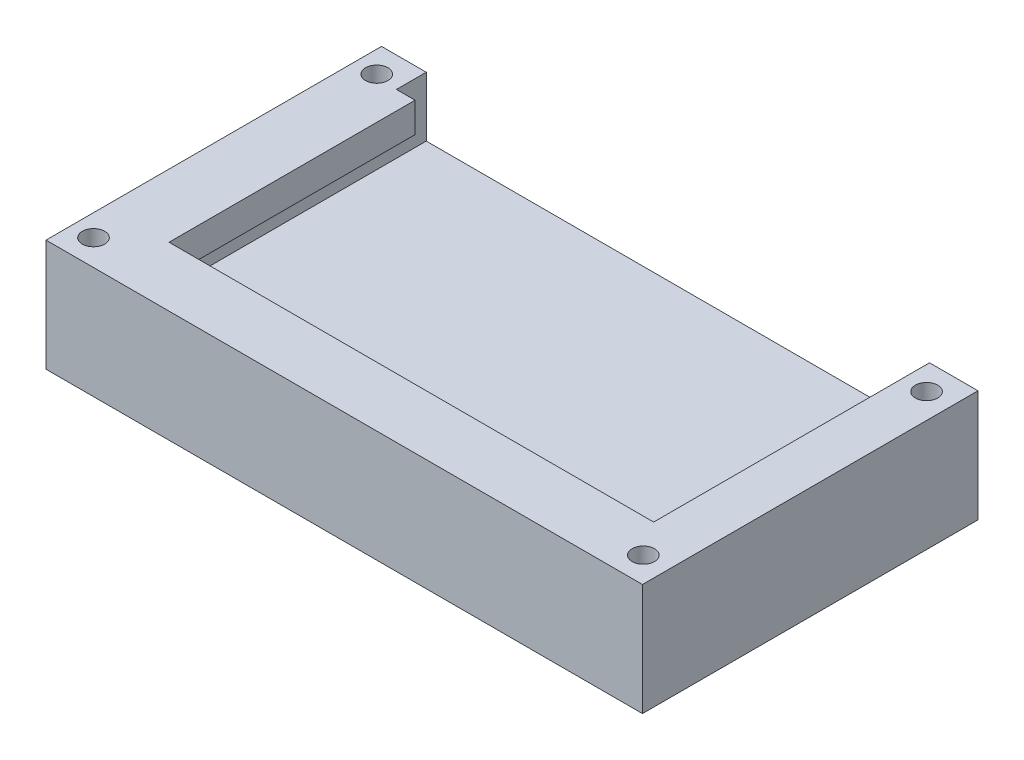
ISO-10303-21;
HEADER;
FILE_DESCRIPTION(('STEP AP214'),'2;1');
FILE_NAME('part.step','',(''),(''),'','','');
FILE_SCHEMA(('AUTOMOTIVE_DESIGN { 1 0 10303 214 1 1 1 1 }'));
ENDSEC;
DATA;
#1=APPLICATION_CONTEXT('core data for automotive mechanical design processes');
#2=APPLICATION_PROTOCOL_DEFINITION('international standard','automotive_design',2000,#1);
#3=PRODUCT_CONTEXT('',#1,'mechanical');
#4=PRODUCT('Part','Part','',(#3));
#5=PRODUCT_RELATED_PRODUCT_CATEGORY('part','',(#4));
#6=PRODUCT_DEFINITION_FORMATION('','',#4);
#7=PRODUCT_DEFINITION_CONTEXT('part definition',#1,'design');
#8=PRODUCT_DEFINITION('design','',#6,#7);
#9=PRODUCT_DEFINITION_SHAPE('','',#8);
#10=(LENGTH_UNIT() NAMED_UNIT(*) SI_UNIT(.MILLI.,.METRE.));
#11=(NAMED_UNIT(*) PLANE_ANGLE_UNIT() SI_UNIT($,.RADIAN.));
#12=(NAMED_UNIT(*) SI_UNIT($,.STERADIAN.) SOLID_ANGLE_UNIT());
#13=UNCERTAINTY_MEASURE_WITH_UNIT(LENGTH_MEASURE(1.E-05),#10,'distance_accuracy_value','');
#14=(GEOMETRIC_REPRESENTATION_CONTEXT(3) GLOBAL_UNCERTAINTY_ASSIGNED_CONTEXT((#13)) GLOBAL_UNIT_ASSIGNED_CONTEXT((#10,
#11,#12)) REPRESENTATION_CONTEXT('',''));
#15=CARTESIAN_POINT('',(0.,0.,0.));
#16=DIRECTION('',(0.,0.,1.));
#17=DIRECTION('',(1.,0.,0.));
#18=AXIS2_PLACEMENT_3D('',#15,#16,#17);
#19=CARTESIAN_POINT('',(80.,15.,0.));
#20=DIRECTION('',(0.,0.,-1.));
#21=DIRECTION('',(-1.,0.,0.));
#22=AXIS2_PLACEMENT_3D('',#19,#20,#21);
#23=PLANE('',#22);
#24=DIRECTION('',(1.,0.,0.));
#25=VECTOR('',#24,1.);
#26=CARTESIAN_POINT('',(80.,0.,0.));
#27=LINE('',#26,#25);
#28=CARTESIAN_POINT('',(0.,0.,0.));
#29=VERTEX_POINT('',#28);
#30=CARTESIAN_POINT('',(80.,0.,0.));
#31=VERTEX_POINT('',#30);
#32=EDGE_CURVE('E191',#29,#31,#27,.T.);
#33=ORIENTED_EDGE('',*,*,#32,.T.);
#34=DIRECTION('',(0.,-1.,0.));
#35=VECTOR('',#34,1.);
#36=CARTESIAN_POINT('',(80.,15.,0.));
#37=LINE('',#36,#35);
#38=CARTESIAN_POINT('',(80.,15.,0.));
#39=VERTEX_POINT('',#38);
#40=EDGE_CURVE('E11',#39,#31,#37,.T.);
#41=ORIENTED_EDGE('',*,*,#40,.F.);
#42=DIRECTION('',(1.,0.,0.));
#43=VECTOR('',#42,1.);
#44=CARTESIAN_POINT('',(80.,15.,0.));
#45=LINE('',#44,#43);
#46=CARTESIAN_POINT('',(0.,15.,0.));
#47=VERTEX_POINT('',#46);
#48=EDGE_CURVE('E203',#47,#39,#45,.T.);
#49=ORIENTED_EDGE('',*,*,#48,.F.);
#50=DIRECTION('',(0.,-1.,0.));
#51=VECTOR('',#50,1.);
#52=CARTESIAN_POINT('',(0.,15.,0.));
#53=LINE('',#52,#51);
#54=EDGE_CURVE('E219',#47,#29,#53,.T.);
#55=ORIENTED_EDGE('',*,*,#54,.T.);
#56=EDGE_LOOP('',(#33,#41,#49,#55));
#57=FACE_BOUND('',#56,.T.);
#58=ADVANCED_FACE('F43',(#57),#23,.F.);
#59=CARTESIAN_POINT('',(80.,15.,-45.));
#60=DIRECTION('',(-1.,0.,0.));
#61=DIRECTION('',(0.,0.,1.));
#62=AXIS2_PLACEMENT_3D('',#59,#60,#61);
#63=PLANE('',#62);
#64=DIRECTION('',(0.,0.,-1.));
#65=VECTOR('',#64,1.);
#66=CARTESIAN_POINT('',(80.,0.,-45.));
#67=LINE('',#66,#65);
#68=CARTESIAN_POINT('',(80.,0.,-45.));
#69=VERTEX_POINT('',#68);
#70=EDGE_CURVE('E223',#31,#69,#67,.T.);
#71=ORIENTED_EDGE('',*,*,#70,.T.);
#72=DIRECTION('',(0.,-1.,0.));
#73=VECTOR('',#72,1.);
#74=CARTESIAN_POINT('',(80.,15.,-45.));
#75=LINE('',#74,#73);
#76=CARTESIAN_POINT('',(80.,15.,-45.));
#77=VERTEX_POINT('',#76);
#78=EDGE_CURVE('E51',#77,#69,#75,.T.);
#79=ORIENTED_EDGE('',*,*,#78,.F.);
#80=DIRECTION('',(0.,0.,-1.));
#81=VECTOR('',#80,1.);
#82=CARTESIAN_POINT('',(80.,15.,-45.));
#83=LINE('',#82,#81);
#84=EDGE_CURVE('E207',#39,#77,#83,.T.);
#85=ORIENTED_EDGE('',*,*,#84,.F.);
#86=ORIENTED_EDGE('',*,*,#40,.T.);
#87=EDGE_LOOP('',(#71,#79,#85,#86));
#88=FACE_BOUND('',#87,.T.);
#89=ADVANCED_FACE('F335',(#88),#63,.F.);
#90=CARTESIAN_POINT('',(0.,15.,-45.));
#91=DIRECTION('',(0.,0.,1.));
#92=DIRECTION('',(1.,0.,0.));
#93=AXIS2_PLACEMENT_3D('',#90,#91,#92);
#94=PLANE('',#93);
#95=DIRECTION('',(-1.,0.,0.));
#96=VECTOR('',#95,1.);
#97=CARTESIAN_POINT('',(0.,15.,-45.));
#98=LINE('',#97,#96);
#99=CARTESIAN_POINT('',(6.,15.,-45.));
#100=VERTEX_POINT('',#99);
#101=CARTESIAN_POINT('',(0.,15.,-45.));
#102=VERTEX_POINT('',#101);
#103=EDGE_CURVE('E211',#100,#102,#98,.T.);
#104=ORIENTED_EDGE('',*,*,#103,.F.);
#105=DIRECTION('',(0.,1.,0.));
#106=VECTOR('',#105,1.);
#107=CARTESIAN_POINT('',(6.,7.,-45.));
#108=LINE('',#107,#106);
#109=CARTESIAN_POINT('',(6.,7.,-45.));
#110=VERTEX_POINT('',#109);
#111=EDGE_CURVE('E188',#110,#100,#108,.T.);
#112=ORIENTED_EDGE('',*,*,#111,.F.);
#113=DIRECTION('',(-1.,0.,0.));
#114=VECTOR('',#113,1.);
#115=CARTESIAN_POINT('',(6.,7.,-45.));
#116=LINE('',#115,#114);
#117=CARTESIAN_POINT('',(73.5,7.,-45.));
#118=VERTEX_POINT('',#117);
#119=EDGE_CURVE('E176',#118,#110,#116,.T.);
#120=ORIENTED_EDGE('',*,*,#119,.F.);
#121=DIRECTION('',(0.,1.,0.));
#122=VECTOR('',#121,1.);
#123=CARTESIAN_POINT('',(73.5,7.,-45.));
#124=LINE('',#123,#122);
#125=CARTESIAN_POINT('',(73.5,15.,-45.));
#126=VERTEX_POINT('',#125);
#127=EDGE_CURVE('E192',#118,#126,#124,.T.);
#128=ORIENTED_EDGE('',*,*,#127,.T.);
#129=EDGE_CURVE('E212',#77,#126,#98,.T.);
#130=ORIENTED_EDGE('',*,*,#129,.F.);
#131=ORIENTED_EDGE('',*,*,#78,.T.);
#132=DIRECTION('',(-1.,0.,0.));
#133=VECTOR('',#132,1.);
#134=CARTESIAN_POINT('',(0.,0.,-45.));
#135=LINE('',#134,#133);
#136=CARTESIAN_POINT('',(0.,0.,-45.));
#137=VERTEX_POINT('',#136);
#138=EDGE_CURVE('E226',#69,#137,#135,.T.);
#139=ORIENTED_EDGE('',*,*,#138,.T.);
#140=DIRECTION('',(0.,-1.,0.));
#141=VECTOR('',#140,1.);
#142=CARTESIAN_POINT('',(0.,15.,-45.));
#143=LINE('',#142,#141);
#144=EDGE_CURVE('E234',#102,#137,#143,.T.);
#145=ORIENTED_EDGE('',*,*,#144,.F.);
#146=EDGE_LOOP('',(#104,#112,#120,#128,#130,#131,#139,#145));
#147=FACE_BOUND('',#146,.T.);
#148=ADVANCED_FACE('F244',(#147),#94,.F.);
#149=CARTESIAN_POINT('',(0.,15.,0.));
#150=DIRECTION('',(1.,0.,0.));
#151=DIRECTION('',(0.,0.,-1.));
#152=AXIS2_PLACEMENT_3D('',#149,#150,#151);
#153=PLANE('',#152);
#154=DIRECTION('',(0.,0.,1.));
#155=VECTOR('',#154,1.);
#156=CARTESIAN_POINT('',(0.,0.,0.));
#157=LINE('',#156,#155);
#158=EDGE_CURVE('E208',#137,#29,#157,.T.);
#159=ORIENTED_EDGE('',*,*,#158,.T.);
#160=ORIENTED_EDGE('',*,*,#54,.F.);
#161=DIRECTION('',(0.,0.,1.));
#162=VECTOR('',#161,1.);
#163=CARTESIAN_POINT('',(0.,15.,0.));
#164=LINE('',#163,#162);
#165=EDGE_CURVE('E216',#102,#47,#164,.T.);
#166=ORIENTED_EDGE('',*,*,#165,.F.);
#167=ORIENTED_EDGE('',*,*,#144,.T.);
#168=EDGE_LOOP('',(#159,#160,#166,#167));
#169=FACE_BOUND('',#168,.T.);
#170=ADVANCED_FACE('F253',(#169),#153,.F.);
#171=CARTESIAN_POINT('',(0.,15.,0.));
#172=DIRECTION('',(0.,-1.,0.));
#173=DIRECTION('',(0.,0.,-1.));
#174=AXIS2_PLACEMENT_3D('',#171,#172,#173);
#175=PLANE('',#174);
#176=CARTESIAN_POINT('',(2.90539873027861,15.,-3.46699967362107));
#177=DIRECTION('',(0.,-1.,0.));
#178=DIRECTION('',(0.,0.,-1.));
#179=AXIS2_PLACEMENT_3D('',#176,#177,#178);
#180=CIRCLE('',#179,1.5);
#181=CARTESIAN_POINT('',(2.90539873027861,15.,-4.96699967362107));
#182=VERTEX_POINT('',#181);
#183=EDGE_CURVE('E158',#182,#182,#180,.T.);
#184=ORIENTED_EDGE('',*,*,#183,.T.);
#185=EDGE_LOOP('',(#184));
#186=FACE_BOUND('',#185,.T.);
#187=CARTESIAN_POINT('',(76.6483204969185,15.,-41.4533643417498));
#188=DIRECTION('',(0.,-1.,0.));
#189=DIRECTION('',(0.,0.,-1.));
#190=AXIS2_PLACEMENT_3D('',#187,#188,#189);
#191=CIRCLE('',#190,1.5);
#192=CARTESIAN_POINT('',(76.6483204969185,15.,-42.9533643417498));
#193=VERTEX_POINT('',#192);
#194=EDGE_CURVE('E280',#193,#193,#191,.T.);
#195=ORIENTED_EDGE('',*,*,#194,.T.);
#196=EDGE_LOOP('',(#195));
#197=FACE_BOUND('',#196,.T.);
#198=CARTESIAN_POINT('',(76.6483204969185,15.,-3.46699967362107));
#199=DIRECTION('',(0.,-1.,0.));
#200=DIRECTION('',(0.,0.,-1.));
#201=AXIS2_PLACEMENT_3D('',#198,#199,#200);
#202=CIRCLE('',#201,1.5);
#203=CARTESIAN_POINT('',(76.6483204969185,15.,-4.96699967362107));
#204=VERTEX_POINT('',#203);
#205=EDGE_CURVE('E284',#204,#204,#202,.T.);
#206=ORIENTED_EDGE('',*,*,#205,.T.);
#207=EDGE_LOOP('',(#206));
#208=FACE_BOUND('',#207,.T.);
#209=CARTESIAN_POINT('',(2.90539873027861,15.,-41.4533643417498));
#210=DIRECTION('',(0.,-1.,0.));
#211=DIRECTION('',(0.,0.,-1.));
#212=AXIS2_PLACEMENT_3D('',#209,#210,#211);
#213=CIRCLE('',#212,1.5);
#214=CARTESIAN_POINT('',(2.90539873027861,15.,-42.9533643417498));
#215=VERTEX_POINT('',#214);
#216=EDGE_CURVE('E288',#215,#215,#213,.T.);
#217=ORIENTED_EDGE('',*,*,#216,.T.);
#218=EDGE_LOOP('',(#217));
#219=FACE_BOUND('',#218,.T.);
#220=DIRECTION('',(1.,0.,0.));
#221=VECTOR('',#220,1.);
#222=CARTESIAN_POINT('',(6.,15.,-8.));
#223=LINE('',#222,#221);
#224=CARTESIAN_POINT('',(8.5,15.,-8.));
#225=VERTEX_POINT('',#224);
#226=CARTESIAN_POINT('',(73.5,15.,-8.));
#227=VERTEX_POINT('',#226);
#228=EDGE_CURVE('E183',#225,#227,#223,.T.);
#229=ORIENTED_EDGE('',*,*,#228,.F.);
#230=DIRECTION('',(0.,0.,-1.));
#231=VECTOR('',#230,1.);
#232=CARTESIAN_POINT('',(8.5,15.,-8.));
#233=LINE('',#232,#231);
#234=CARTESIAN_POINT('',(8.5,15.,-41.));
#235=VERTEX_POINT('',#234);
#236=EDGE_CURVE('E155',#225,#235,#233,.T.);
#237=ORIENTED_EDGE('',*,*,#236,.T.);
#238=DIRECTION('',(-1.,0.,0.));
#239=VECTOR('',#238,1.);
#240=CARTESIAN_POINT('',(6.,15.,-41.));
#241=LINE('',#240,#239);
#242=CARTESIAN_POINT('',(6.,15.,-41.));
#243=VERTEX_POINT('',#242);
#244=EDGE_CURVE('E130',#235,#243,#241,.T.);
#245=ORIENTED_EDGE('',*,*,#244,.T.);
#246=DIRECTION('',(0.,0.,1.));
#247=VECTOR('',#246,1.);
#248=CARTESIAN_POINT('',(6.,15.,-45.));
#249=LINE('',#248,#247);
#250=EDGE_CURVE('E63',#100,#243,#249,.T.);
#251=ORIENTED_EDGE('',*,*,#250,.F.);
#252=ORIENTED_EDGE('',*,*,#103,.T.);
#253=ORIENTED_EDGE('',*,*,#165,.T.);
#254=ORIENTED_EDGE('',*,*,#48,.T.);
#255=ORIENTED_EDGE('',*,*,#84,.T.);
#256=ORIENTED_EDGE('',*,*,#129,.T.);
#257=DIRECTION('',(0.,0.,-1.));
#258=VECTOR('',#257,1.);
#259=CARTESIAN_POINT('',(73.5,15.,-45.));
#260=LINE('',#259,#258);
#261=EDGE_CURVE('E168',#227,#126,#260,.T.);
#262=ORIENTED_EDGE('',*,*,#261,.F.);
#263=EDGE_LOOP('',(#229,#237,#245,#251,#252,#253,#254,#255,#256,#262));
#264=FACE_BOUND('',#263,.T.);
#265=ADVANCED_FACE('F259',(#186,#197,#208,#219,#264),#175,.F.);
#266=CARTESIAN_POINT('',(0.,0.,0.));
#267=DIRECTION('',(0.,-1.,0.));
#268=DIRECTION('',(0.,0.,-1.));
#269=AXIS2_PLACEMENT_3D('',#266,#267,#268);
#270=PLANE('',#269);
#271=CARTESIAN_POINT('',(2.90539873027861,0.,-3.46699967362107));
#272=DIRECTION('',(0.,1.,0.));
#273=DIRECTION('',(0.,0.,1.));
#274=AXIS2_PLACEMENT_3D('',#271,#272,#273);
#275=CIRCLE('',#274,1.5);
#276=CARTESIAN_POINT('',(2.90539873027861,0.,-1.96699967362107));
#277=VERTEX_POINT('',#276);
#278=EDGE_CURVE('E297',#277,#277,#275,.T.);
#279=ORIENTED_EDGE('',*,*,#278,.T.);
#280=EDGE_LOOP('',(#279));
#281=FACE_BOUND('',#280,.T.);
#282=CARTESIAN_POINT('',(76.6483204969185,0.,-41.4533643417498));
#283=DIRECTION('',(0.,1.,0.));
#284=DIRECTION('',(0.,0.,1.));
#285=AXIS2_PLACEMENT_3D('',#282,#283,#284);
#286=CIRCLE('',#285,1.5);
#287=CARTESIAN_POINT('',(76.6483204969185,0.,-39.9533643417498));
#288=VERTEX_POINT('',#287);
#289=EDGE_CURVE('E301',#288,#288,#286,.T.);
#290=ORIENTED_EDGE('',*,*,#289,.T.);
#291=EDGE_LOOP('',(#290));
#292=FACE_BOUND('',#291,.T.);
#293=CARTESIAN_POINT('',(76.6483204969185,0.,-3.46699967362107));
#294=DIRECTION('',(0.,1.,0.));
#295=DIRECTION('',(0.,0.,1.));
#296=AXIS2_PLACEMENT_3D('',#293,#294,#295);
#297=CIRCLE('',#296,1.5);
#298=CARTESIAN_POINT('',(76.6483204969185,0.,-1.96699967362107));
#299=VERTEX_POINT('',#298);
#300=EDGE_CURVE('E296',#299,#299,#297,.T.);
#301=ORIENTED_EDGE('',*,*,#300,.T.);
#302=EDGE_LOOP('',(#301));
#303=FACE_BOUND('',#302,.T.);
#304=CARTESIAN_POINT('',(2.90539873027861,0.,-41.4533643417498));
#305=DIRECTION('',(0.,1.,0.));
#306=DIRECTION('',(0.,0.,1.));
#307=AXIS2_PLACEMENT_3D('',#304,#305,#306);
#308=CIRCLE('',#307,1.5);
#309=CARTESIAN_POINT('',(2.90539873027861,0.,-39.9533643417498));
#310=VERTEX_POINT('',#309);
#311=EDGE_CURVE('E292',#310,#310,#308,.T.);
#312=ORIENTED_EDGE('',*,*,#311,.T.);
#313=EDGE_LOOP('',(#312));
#314=FACE_BOUND('',#313,.T.);
#315=ORIENTED_EDGE('',*,*,#32,.F.);
#316=ORIENTED_EDGE('',*,*,#158,.F.);
#317=ORIENTED_EDGE('',*,*,#138,.F.);
#318=ORIENTED_EDGE('',*,*,#70,.F.);
#319=EDGE_LOOP('',(#315,#316,#317,#318));
#320=FACE_BOUND('',#319,.T.);
#321=ADVANCED_FACE('F250',(#281,#292,#303,#314,#320),#270,.T.);
#322=CARTESIAN_POINT('',(6.,7.,-45.));
#323=DIRECTION('',(-1.,0.,0.));
#324=DIRECTION('',(0.,0.,1.));
#325=AXIS2_PLACEMENT_3D('',#322,#323,#324);
#326=PLANE('',#325);
#327=ORIENTED_EDGE('',*,*,#250,.T.);
#328=DIRECTION('',(0.,1.,0.));
#329=VECTOR('',#328,1.);
#330=CARTESIAN_POINT('',(6.,11.,-41.));
#331=LINE('',#330,#329);
#332=CARTESIAN_POINT('',(6.,11.,-41.));
#333=VERTEX_POINT('',#332);
#334=EDGE_CURVE('E58',#333,#243,#331,.T.);
#335=ORIENTED_EDGE('',*,*,#334,.F.);
#336=DIRECTION('',(0.,0.,1.));
#337=VECTOR('',#336,1.);
#338=CARTESIAN_POINT('',(6.,11.,-8.));
#339=LINE('',#338,#337);
#340=CARTESIAN_POINT('',(6.,11.,-8.));
#341=VERTEX_POINT('',#340);
#342=EDGE_CURVE('E148',#333,#341,#339,.T.);
#343=ORIENTED_EDGE('',*,*,#342,.T.);
#344=DIRECTION('',(0.,1.,0.));
#345=VECTOR('',#344,1.);
#346=CARTESIAN_POINT('',(6.,7.,-8.));
#347=LINE('',#346,#345);
#348=CARTESIAN_POINT('',(6.,7.,-8.));
#349=VERTEX_POINT('',#348);
#350=EDGE_CURVE('E180',#349,#341,#347,.T.);
#351=ORIENTED_EDGE('',*,*,#350,.F.);
#352=DIRECTION('',(0.,0.,1.));
#353=VECTOR('',#352,1.);
#354=CARTESIAN_POINT('',(6.,7.,-45.));
#355=LINE('',#354,#353);
#356=EDGE_CURVE('E163',#110,#349,#355,.T.);
#357=ORIENTED_EDGE('',*,*,#356,.F.);
#358=ORIENTED_EDGE('',*,*,#111,.T.);
#359=EDGE_LOOP('',(#327,#335,#343,#351,#357,#358));
#360=FACE_BOUND('',#359,.T.);
#361=ADVANCED_FACE('F263',(#360),#326,.F.);
#362=CARTESIAN_POINT('',(73.5,7.,-45.));
#363=DIRECTION('',(1.,0.,0.));
#364=DIRECTION('',(0.,0.,-1.));
#365=AXIS2_PLACEMENT_3D('',#362,#363,#364);
#366=PLANE('',#365);
#367=ORIENTED_EDGE('',*,*,#261,.T.);
#368=ORIENTED_EDGE('',*,*,#127,.F.);
#369=DIRECTION('',(0.,0.,-1.));
#370=VECTOR('',#369,1.);
#371=CARTESIAN_POINT('',(73.5,7.,-45.));
#372=LINE('',#371,#370);
#373=CARTESIAN_POINT('',(73.5,7.,-8.));
#374=VERTEX_POINT('',#373);
#375=EDGE_CURVE('E172',#374,#118,#372,.T.);
#376=ORIENTED_EDGE('',*,*,#375,.F.);
#377=DIRECTION('',(0.,1.,0.));
#378=VECTOR('',#377,1.);
#379=CARTESIAN_POINT('',(73.5,7.,-8.));
#380=LINE('',#379,#378);
#381=EDGE_CURVE('E196',#374,#227,#380,.T.);
#382=ORIENTED_EDGE('',*,*,#381,.T.);
#383=EDGE_LOOP('',(#367,#368,#376,#382));
#384=FACE_BOUND('',#383,.T.);
#385=ADVANCED_FACE('F269',(#384),#366,.F.);
#386=CARTESIAN_POINT('',(6.,7.,-8.));
#387=DIRECTION('',(0.,0.,1.));
#388=DIRECTION('',(1.,0.,0.));
#389=AXIS2_PLACEMENT_3D('',#386,#387,#388);
#390=PLANE('',#389);
#391=DIRECTION('',(1.,0.,0.));
#392=VECTOR('',#391,1.);
#393=CARTESIAN_POINT('',(6.,11.,-8.));
#394=LINE('',#393,#392);
#395=CARTESIAN_POINT('',(8.5,11.,-8.));
#396=VERTEX_POINT('',#395);
#397=EDGE_CURVE('E145',#341,#396,#394,.T.);
#398=ORIENTED_EDGE('',*,*,#397,.T.);
#399=DIRECTION('',(0.,1.,0.));
#400=VECTOR('',#399,1.);
#401=CARTESIAN_POINT('',(8.5,11.,-8.));
#402=LINE('',#401,#400);
#403=EDGE_CURVE('E135',#396,#225,#402,.T.);
#404=ORIENTED_EDGE('',*,*,#403,.T.);
#405=ORIENTED_EDGE('',*,*,#228,.T.);
#406=ORIENTED_EDGE('',*,*,#381,.F.);
#407=DIRECTION('',(1.,0.,0.));
#408=VECTOR('',#407,1.);
#409=CARTESIAN_POINT('',(6.,7.,-8.));
#410=LINE('',#409,#408);
#411=EDGE_CURVE('E167',#349,#374,#410,.T.);
#412=ORIENTED_EDGE('',*,*,#411,.F.);
#413=ORIENTED_EDGE('',*,*,#350,.T.);
#414=EDGE_LOOP('',(#398,#404,#405,#406,#412,#413));
#415=FACE_BOUND('',#414,.T.);
#416=ADVANCED_FACE('F272',(#415),#390,.F.);
#417=CARTESIAN_POINT('',(0.,7.,0.));
#418=DIRECTION('',(0.,1.,0.));
#419=DIRECTION('',(0.,0.,1.));
#420=AXIS2_PLACEMENT_3D('',#417,#418,#419);
#421=PLANE('',#420);
#422=ORIENTED_EDGE('',*,*,#356,.T.);
#423=ORIENTED_EDGE('',*,*,#411,.T.);
#424=ORIENTED_EDGE('',*,*,#375,.T.);
#425=ORIENTED_EDGE('',*,*,#119,.T.);
#426=EDGE_LOOP('',(#422,#423,#424,#425));
#427=FACE_BOUND('',#426,.T.);
#428=ADVANCED_FACE('F266',(#427),#421,.T.);
#429=CARTESIAN_POINT('',(6.,11.,-41.));
#430=DIRECTION('',(0.,0.,-1.));
#431=DIRECTION('',(-1.,0.,0.));
#432=AXIS2_PLACEMENT_3D('',#429,#430,#431);
#433=PLANE('',#432);
#434=ORIENTED_EDGE('',*,*,#244,.F.);
#435=DIRECTION('',(0.,1.,0.));
#436=VECTOR('',#435,1.);
#437=CARTESIAN_POINT('',(8.5,11.,-41.));
#438=LINE('',#437,#436);
#439=CARTESIAN_POINT('',(8.5,11.,-41.));
#440=VERTEX_POINT('',#439);
#441=EDGE_CURVE('E124',#440,#235,#438,.T.);
#442=ORIENTED_EDGE('',*,*,#441,.F.);
#443=DIRECTION('',(-1.,0.,0.));
#444=VECTOR('',#443,1.);
#445=CARTESIAN_POINT('',(6.,11.,-41.));
#446=LINE('',#445,#444);
#447=EDGE_CURVE('E128',#440,#333,#446,.T.);
#448=ORIENTED_EDGE('',*,*,#447,.T.);
#449=ORIENTED_EDGE('',*,*,#334,.T.);
#450=EDGE_LOOP('',(#434,#442,#448,#449));
#451=FACE_BOUND('',#450,.T.);
#452=ADVANCED_FACE('F126',(#451),#433,.T.);
#453=CARTESIAN_POINT('',(8.5,11.,-8.));
#454=DIRECTION('',(1.,0.,0.));
#455=DIRECTION('',(0.,0.,-1.));
#456=AXIS2_PLACEMENT_3D('',#453,#454,#455);
#457=PLANE('',#456);
#458=ORIENTED_EDGE('',*,*,#236,.F.);
#459=ORIENTED_EDGE('',*,*,#403,.F.);
#460=DIRECTION('',(0.,0.,-1.));
#461=VECTOR('',#460,1.);
#462=CARTESIAN_POINT('',(8.5,11.,-8.));
#463=LINE('',#462,#461);
#464=EDGE_CURVE('E139',#396,#440,#463,.T.);
#465=ORIENTED_EDGE('',*,*,#464,.T.);
#466=ORIENTED_EDGE('',*,*,#441,.T.);
#467=EDGE_LOOP('',(#458,#459,#465,#466));
#468=FACE_BOUND('',#467,.T.);
#469=ADVANCED_FACE('F140',(#468),#457,.T.);
#470=CARTESIAN_POINT('',(0.,11.,0.));
#471=DIRECTION('',(0.,-1.,0.));
#472=DIRECTION('',(0.,0.,-1.));
#473=AXIS2_PLACEMENT_3D('',#470,#471,#472);
#474=PLANE('',#473);
#475=ORIENTED_EDGE('',*,*,#342,.F.);
#476=ORIENTED_EDGE('',*,*,#447,.F.);
#477=ORIENTED_EDGE('',*,*,#464,.F.);
#478=ORIENTED_EDGE('',*,*,#397,.F.);
#479=EDGE_LOOP('',(#475,#476,#477,#478));
#480=FACE_BOUND('',#479,.T.);
#481=ADVANCED_FACE('F147',(#480),#474,.T.);
#482=CARTESIAN_POINT('',(2.90539873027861,0.,-41.4533643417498));
#483=DIRECTION('',(0.,1.,0.));
#484=DIRECTION('',(0.,0.,1.));
#485=AXIS2_PLACEMENT_3D('',#482,#483,#484);
#486=CYLINDRICAL_SURFACE('',#485,1.5);
#487=ORIENTED_EDGE('',*,*,#311,.F.);
#488=EDGE_LOOP('',(#487));
#489=FACE_BOUND('',#488,.T.);
#490=ORIENTED_EDGE('',*,*,#216,.F.);
#491=EDGE_LOOP('',(#490));
#492=FACE_BOUND('',#491,.T.);
#493=ADVANCED_FACE('F315',(#489,#492),#486,.F.);
#494=CARTESIAN_POINT('',(76.6483204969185,0.,-3.46699967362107));
#495=DIRECTION('',(0.,1.,0.));
#496=DIRECTION('',(0.,0.,1.));
#497=AXIS2_PLACEMENT_3D('',#494,#495,#496);
#498=CYLINDRICAL_SURFACE('',#497,1.5);
#499=ORIENTED_EDGE('',*,*,#300,.F.);
#500=EDGE_LOOP('',(#499));
#501=FACE_BOUND('',#500,.T.);
#502=ORIENTED_EDGE('',*,*,#205,.F.);
#503=EDGE_LOOP('',(#502));
#504=FACE_BOUND('',#503,.T.);
#505=ADVANCED_FACE('F311',(#501,#504),#498,.F.);
#506=CARTESIAN_POINT('',(76.6483204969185,0.,-41.4533643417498));
#507=DIRECTION('',(0.,1.,0.));
#508=DIRECTION('',(0.,0.,1.));
#509=AXIS2_PLACEMENT_3D('',#506,#507,#508);
#510=CYLINDRICAL_SURFACE('',#509,1.5);
#511=ORIENTED_EDGE('',*,*,#289,.F.);
#512=EDGE_LOOP('',(#511));
#513=FACE_BOUND('',#512,.T.);
#514=ORIENTED_EDGE('',*,*,#194,.F.);
#515=EDGE_LOOP('',(#514));
#516=FACE_BOUND('',#515,.T.);
#517=ADVANCED_FACE('F314',(#513,#516),#510,.F.);
#518=CARTESIAN_POINT('',(2.90539873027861,0.,-3.46699967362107));
#519=DIRECTION('',(0.,1.,0.));
#520=DIRECTION('',(0.,0.,1.));
#521=AXIS2_PLACEMENT_3D('',#518,#519,#520);
#522=CYLINDRICAL_SURFACE('',#521,1.5);
#523=ORIENTED_EDGE('',*,*,#278,.F.);
#524=EDGE_LOOP('',(#523));
#525=FACE_BOUND('',#524,.T.);
#526=ORIENTED_EDGE('',*,*,#183,.F.);
#527=EDGE_LOOP('',(#526));
#528=FACE_BOUND('',#527,.T.);
#529=ADVANCED_FACE('F411',(#525,#528),#522,.F.);
#530=CLOSED_SHELL('',(#58,#89,#148,#170,#265,#321,#361,#385,#416,#428,#452,#469,#481,#493,#505,
#517,#529));
#531=MANIFOLD_SOLID_BREP('B2',#530);
#532=ADVANCED_BREP_SHAPE_REPRESENTATION('',(#18,#531),#14);
#533=SHAPE_DEFINITION_REPRESENTATION(#9,#532);
ENDSEC;
END-ISO-10303-21;
